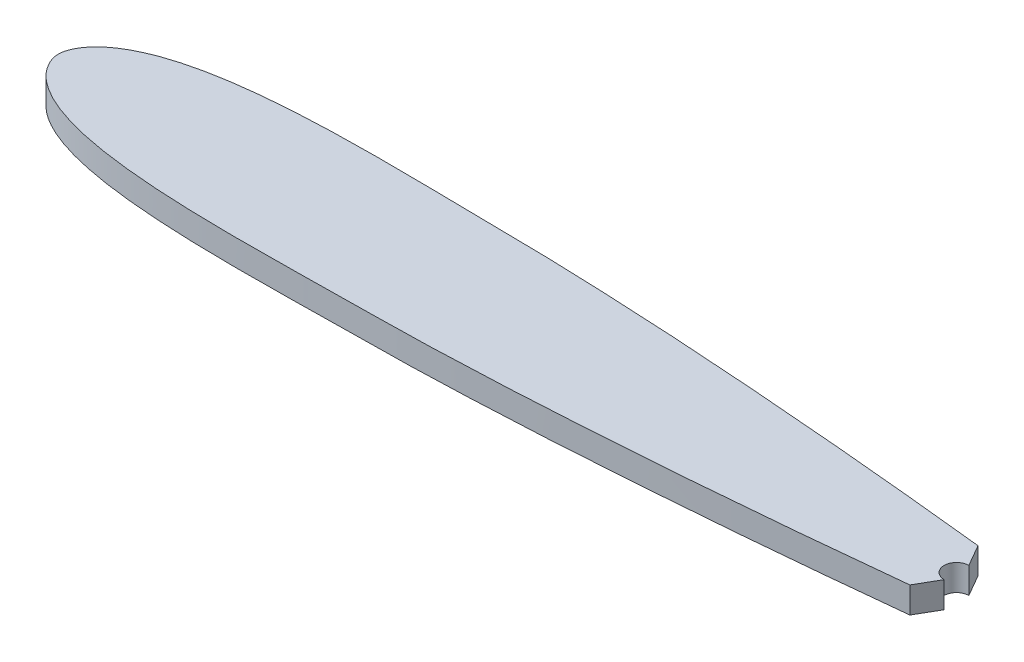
ISO-10303-21;
HEADER;
FILE_DESCRIPTION(('STEP AP214'),'2;1');
FILE_NAME('part.step','',(''),(''),'','','');
FILE_SCHEMA(('AUTOMOTIVE_DESIGN { 1 0 10303 214 1 1 1 1 }'));
ENDSEC;
DATA;
#1=APPLICATION_CONTEXT('core data for automotive mechanical design processes');
#2=APPLICATION_PROTOCOL_DEFINITION('international standard','automotive_design',2000,#1);
#3=PRODUCT_CONTEXT('',#1,'mechanical');
#4=PRODUCT('Part','Part','',(#3));
#5=PRODUCT_RELATED_PRODUCT_CATEGORY('part','',(#4));
#6=PRODUCT_DEFINITION_FORMATION('','',#4);
#7=PRODUCT_DEFINITION_CONTEXT('part definition',#1,'design');
#8=PRODUCT_DEFINITION('design','',#6,#7);
#9=PRODUCT_DEFINITION_SHAPE('','',#8);
#10=(LENGTH_UNIT() NAMED_UNIT(*) SI_UNIT(.MILLI.,.METRE.));
#11=(NAMED_UNIT(*) PLANE_ANGLE_UNIT() SI_UNIT($,.RADIAN.));
#12=(NAMED_UNIT(*) SI_UNIT($,.STERADIAN.) SOLID_ANGLE_UNIT());
#13=UNCERTAINTY_MEASURE_WITH_UNIT(LENGTH_MEASURE(1.E-05),#10,'distance_accuracy_value','');
#14=(GEOMETRIC_REPRESENTATION_CONTEXT(3) GLOBAL_UNCERTAINTY_ASSIGNED_CONTEXT((#13)) GLOBAL_UNIT_ASSIGNED_CONTEXT((#10,
#11,#12)) REPRESENTATION_CONTEXT('',''));
#15=CARTESIAN_POINT('',(0.,0.,0.));
#16=DIRECTION('',(0.,0.,1.));
#17=DIRECTION('',(1.,0.,0.));
#18=AXIS2_PLACEMENT_3D('',#15,#16,#17);
#19=CARTESIAN_POINT('',(67.7790397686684,3.175,-0.131246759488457));
#20=CARTESIAN_POINT('',(65.0370068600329,3.175,-0.509034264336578));
#21=CARTESIAN_POINT('',(59.9652619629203,3.175,-1.21325090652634));
#22=CARTESIAN_POINT('',(52.5544718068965,3.175,-2.15837468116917));
#23=CARTESIAN_POINT('',(45.5543935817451,3.175,-3.00647836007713));
#24=CARTESIAN_POINT('',(36.2238895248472,3.175,-4.06883233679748));
#25=CARTESIAN_POINT('',(26.8903333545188,3.175,-5.04184253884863));
#26=CARTESIAN_POINT('',(17.5539686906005,3.175,-5.91943711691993));
#27=CARTESIAN_POINT('',(10.5538202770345,3.175,-6.52129772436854));
#28=CARTESIAN_POINT('',(3.55392530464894,3.175,-7.06802957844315));
#29=CARTESIAN_POINT('',(-3.49280084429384,3.175,-7.55014307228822));
#30=CARTESIAN_POINT('',(-10.5393160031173,3.175,-7.96271458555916));
#31=CARTESIAN_POINT('',(-17.5865793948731,3.175,-8.2681854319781));
#32=CARTESIAN_POINT('',(-24.5870390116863,3.175,-8.49389357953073));
#33=CARTESIAN_POINT('',(-30.3756781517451,3.175,-8.48994880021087));
#34=CARTESIAN_POINT('',(-34.9949715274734,3.175,-8.59752197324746));
#35=CARTESIAN_POINT('',(-40.7817640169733,3.175,-8.67810250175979));
#36=CARTESIAN_POINT('',(-47.7881212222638,3.175,-8.68162886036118));
#37=CARTESIAN_POINT('',(-54.7937707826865,3.175,-8.31167413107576));
#38=CARTESIAN_POINT('',(-59.22630516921,3.175,-7.81823452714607));
#39=CARTESIAN_POINT('',(-62.2656748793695,3.175,-7.31987094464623));
#40=CARTESIAN_POINT('',(-64.6009038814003,3.175,-6.7884320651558));
#41=CARTESIAN_POINT('',(-66.4620466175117,3.175,-6.22573553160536));
#42=CARTESIAN_POINT('',(-67.8707051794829,3.175,-5.7108879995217));
#43=CARTESIAN_POINT('',(-69.2876418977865,3.175,-5.0652949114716));
#44=CARTESIAN_POINT('',(-70.7296719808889,3.175,-4.21938046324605));
#45=CARTESIAN_POINT('',(-71.9258731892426,3.175,-3.23008464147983));
#46=CARTESIAN_POINT('',(-72.9793832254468,3.175,-1.90586842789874));
#47=CARTESIAN_POINT('',(-73.754817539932,3.175,-0.124102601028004));
#48=CARTESIAN_POINT('',(-72.9793832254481,3.175,1.6576632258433));
#49=CARTESIAN_POINT('',(-71.9258731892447,3.175,2.98187943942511));
#50=CARTESIAN_POINT('',(-70.7296719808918,3.175,3.97117526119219));
#51=CARTESIAN_POINT('',(-69.28764189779,3.175,4.81708970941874));
#52=CARTESIAN_POINT('',(-67.8707051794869,3.175,5.46268279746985));
#53=CARTESIAN_POINT('',(-66.4620466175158,3.175,5.9775303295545));
#54=CARTESIAN_POINT('',(-64.6009038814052,3.175,6.54022686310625));
#55=CARTESIAN_POINT('',(-62.2656748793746,3.175,7.07166574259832));
#56=CARTESIAN_POINT('',(-59.2263051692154,3.175,7.57002932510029));
#57=CARTESIAN_POINT('',(-54.7937707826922,3.175,8.06346892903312));
#58=CARTESIAN_POINT('',(-47.7881212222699,3.175,8.43342365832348));
#59=CARTESIAN_POINT('',(-40.7817640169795,3.175,8.42989729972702));
#60=CARTESIAN_POINT('',(-34.9949715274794,3.175,8.34931677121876));
#61=CARTESIAN_POINT('',(-30.375678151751,3.175,8.24174359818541));
#62=CARTESIAN_POINT('',(-24.5870390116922,3.175,8.24568837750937));
#63=CARTESIAN_POINT('',(-17.5865793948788,3.175,8.01998022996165));
#64=CARTESIAN_POINT('',(-10.5393160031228,3.175,7.71450938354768));
#65=CARTESIAN_POINT('',(-3.492800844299,3.175,7.30193787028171));
#66=CARTESIAN_POINT('',(3.55392530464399,3.175,6.8198243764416));
#67=CARTESIAN_POINT('',(10.5538202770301,3.175,6.27309252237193));
#68=CARTESIAN_POINT('',(17.5539686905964,3.175,5.67123191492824));
#69=CARTESIAN_POINT('',(26.8903333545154,3.175,4.79363733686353));
#70=CARTESIAN_POINT('',(36.2238895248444,3.175,3.82062713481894));
#71=CARTESIAN_POINT('',(45.5543935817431,3.175,2.75827315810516));
#72=CARTESIAN_POINT('',(52.5544718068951,3.175,1.91016947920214));
#73=CARTESIAN_POINT('',(59.9715547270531,3.175,0.964243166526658));
#74=CARTESIAN_POINT('',(65.0495736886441,3.175,0.259084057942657));
#75=CARTESIAN_POINT('',(67.7978926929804,3.175,-0.119555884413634));
#76=B_SPLINE_CURVE_WITH_KNOTS('',3,(#19,#20,#21,#22,#23,#24,#25,#26,#27,#28,#29,#30,#31,#32,#33,
#34,#35,#36,#37,#38,#39,#40,#41,#42,#43,#44,#45,#46,#47,#48,#49,#50,#51,#52,#53,#54,#55,#56,#57,
#58,#59,#60,#61,#62,#63,#64,#65,#66,#67,#68,#69,#70,#71,#72,#73,#74,#75),.UNSPECIFIED.,.F.,.F.,
(4,1,1,1,1,1,1,1,1,1,1,1,1,1,1,1,1,1,1,1,1,1,1,1,1,1,1,1,1,1,1,1,1,1,1,1,1,1,1,1,1,1,1,1,1,1,1,
1,1,1,1,1,1,1,4),(-0.00432084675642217,0.0246342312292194,0.0492428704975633,0.0738297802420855,
0.0983967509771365,0.147478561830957,0.171994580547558,0.196493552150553,0.220976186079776,
0.245442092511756,0.270380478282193,0.29481296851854,0.319231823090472,0.343641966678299,
0.355360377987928,0.367566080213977,0.404182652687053,0.428636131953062,0.440920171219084,
0.450818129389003,0.460843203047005,0.465945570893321,0.471149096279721,0.476522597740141,
0.482208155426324,0.488618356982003,0.492567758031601,0.5,0.507432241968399,0.511381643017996,
0.517791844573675,0.523477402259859,0.528850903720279,0.534054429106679,0.539156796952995,
0.549181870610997,0.559079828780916,0.571363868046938,0.595817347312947,0.632433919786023,
0.644639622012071,0.656358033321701,0.680768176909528,0.70518703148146,0.729619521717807,
0.754557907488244,0.779023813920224,0.803506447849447,0.828005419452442,0.852521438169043,
0.901603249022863,0.926170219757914,0.950757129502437,0.975365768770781,1.00438720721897),.UNSPECIFIED.);
#77=DIRECTION('',(0.,-1.,0.));
#78=VECTOR('',#77,1.);
#79=SURFACE_OF_LINEAR_EXTRUSION('',#76,#78);
#80=CARTESIAN_POINT('',(34.2509462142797,3.175,4.01545479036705));
#81=CARTESIAN_POINT('',(31.0193228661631,3.175,4.36017962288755));
#82=CARTESIAN_POINT('',(25.4546897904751,3.175,4.9285841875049));
#83=CARTESIAN_POINT('',(17.5539686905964,3.175,5.67123191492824));
#84=CARTESIAN_POINT('',(10.5538202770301,3.175,6.27309252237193));
#85=CARTESIAN_POINT('',(3.55392530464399,3.175,6.8198243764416));
#86=CARTESIAN_POINT('',(-3.492800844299,3.175,7.30193787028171));
#87=CARTESIAN_POINT('',(-10.5393160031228,3.175,7.71450938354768));
#88=CARTESIAN_POINT('',(-17.5865793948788,3.175,8.01998022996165));
#89=CARTESIAN_POINT('',(-24.5870390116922,3.175,8.24568837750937));
#90=CARTESIAN_POINT('',(-30.375678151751,3.175,8.24174359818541));
#91=CARTESIAN_POINT('',(-34.9949715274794,3.175,8.34931677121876));
#92=CARTESIAN_POINT('',(-40.7817640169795,3.175,8.42989729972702));
#93=CARTESIAN_POINT('',(-47.7881212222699,3.175,8.43342365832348));
#94=CARTESIAN_POINT('',(-54.7937707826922,3.175,8.06346892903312));
#95=CARTESIAN_POINT('',(-59.2263051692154,3.175,7.57002932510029));
#96=CARTESIAN_POINT('',(-62.2656748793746,3.175,7.07166574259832));
#97=CARTESIAN_POINT('',(-64.6009038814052,3.175,6.54022686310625));
#98=CARTESIAN_POINT('',(-66.4620466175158,3.175,5.9775303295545));
#99=CARTESIAN_POINT('',(-67.8707051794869,3.175,5.46268279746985));
#100=CARTESIAN_POINT('',(-69.28764189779,3.175,4.81708970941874));
#101=CARTESIAN_POINT('',(-70.7296719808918,3.175,3.97117526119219));
#102=CARTESIAN_POINT('',(-71.9258731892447,3.175,2.98187943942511));
#103=CARTESIAN_POINT('',(-72.9793832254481,3.175,1.6576632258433));
#104=CARTESIAN_POINT('',(-73.754817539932,3.175,-0.124102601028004));
#105=CARTESIAN_POINT('',(-72.9793832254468,3.175,-1.90586842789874));
#106=CARTESIAN_POINT('',(-71.9258731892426,3.175,-3.23008464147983));
#107=CARTESIAN_POINT('',(-70.7296719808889,3.175,-4.21938046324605));
#108=CARTESIAN_POINT('',(-69.2876418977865,3.175,-5.0652949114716));
#109=CARTESIAN_POINT('',(-67.8707051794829,3.175,-5.7108879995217));
#110=CARTESIAN_POINT('',(-66.4620466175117,3.175,-6.22573553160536));
#111=CARTESIAN_POINT('',(-64.6009038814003,3.175,-6.7884320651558));
#112=CARTESIAN_POINT('',(-62.2656748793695,3.175,-7.31987094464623));
#113=CARTESIAN_POINT('',(-59.22630516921,3.175,-7.81823452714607));
#114=CARTESIAN_POINT('',(-54.7937707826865,3.175,-8.31167413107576));
#115=CARTESIAN_POINT('',(-47.7881212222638,3.175,-8.68162886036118));
#116=CARTESIAN_POINT('',(-40.7817640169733,3.175,-8.67810250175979));
#117=CARTESIAN_POINT('',(-34.9949715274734,3.175,-8.59752197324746));
#118=CARTESIAN_POINT('',(-30.3756781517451,3.175,-8.48994880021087));
#119=CARTESIAN_POINT('',(-24.5870390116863,3.175,-8.49389357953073));
#120=CARTESIAN_POINT('',(-17.5865793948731,3.175,-8.2681854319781));
#121=CARTESIAN_POINT('',(-10.5393160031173,3.175,-7.96271458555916));
#122=CARTESIAN_POINT('',(-3.49280084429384,3.175,-7.55014307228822));
#123=CARTESIAN_POINT('',(3.55392530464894,3.175,-7.06802957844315));
#124=CARTESIAN_POINT('',(10.5538202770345,3.175,-6.52129772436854));
#125=CARTESIAN_POINT('',(17.5539686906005,3.175,-5.91943711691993));
#126=CARTESIAN_POINT('',(25.4576237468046,3.175,-5.17651360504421));
#127=CARTESIAN_POINT('',(31.0251861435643,3.175,-4.60778590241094));
#128=CARTESIAN_POINT('',(34.2597369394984,3.175,-4.26272222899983));
#129=B_SPLINE_CURVE_WITH_KNOTS('',3,(#80,#81,#82,#83,#84,#85,#86,#87,#88,#89,#90,#91,#92,#93,
#94,#95,#96,#97,#98,#99,#100,#101,#102,#103,#104,#105,#106,#107,#108,#109,#110,#111,#112,#113,
#114,#115,#116,#117,#118,#119,#120,#121,#122,#123,#124,#125,#126,#127,#128),.UNSPECIFIED.,.F.,
.F.,(4,1,1,1,1,1,1,1,1,1,1,1,1,1,1,1,1,1,1,1,1,1,1,1,1,1,1,1,1,1,1,1,1,1,1,1,1,1,1,1,1,1,1,1,1,
1,4),(0.113450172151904,0.147447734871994,0.171963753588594,0.196462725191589,0.220945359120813,
0.245411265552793,0.27034965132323,0.294782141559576,0.319200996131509,0.343611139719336,
0.355329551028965,0.367535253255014,0.404151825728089,0.428605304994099,0.440889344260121,
0.45078730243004,0.460812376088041,0.465914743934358,0.471118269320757,0.476491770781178,
0.482177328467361,0.48858753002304,0.492536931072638,0.499969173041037,0.507401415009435,
0.511350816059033,0.517761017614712,0.523446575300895,0.528820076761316,0.534023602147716,
0.539125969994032,0.549151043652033,0.559049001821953,0.571333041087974,0.595786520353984,
0.63240309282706,0.644608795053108,0.656327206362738,0.680737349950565,0.705156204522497,
0.729588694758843,0.754527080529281,0.77899298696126,0.803475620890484,0.827974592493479,
0.852490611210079,0.886519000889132),.UNSPECIFIED.);
#130=CARTESIAN_POINT('',(34.2597400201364,3.175,-4.26275110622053));
#131=VERTEX_POINT('',#130);
#132=CARTESIAN_POINT('',(34.2509492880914,3.175,4.01548360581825));
#133=VERTEX_POINT('',#132);
#134=EDGE_CURVE('E11',#131,#133,#129,.F.);
#135=ORIENTED_EDGE('',*,*,#134,.F.);
#136=DIRECTION('',(0.,-1.,0.));
#137=VECTOR('',#136,1.);
#138=CARTESIAN_POINT('',(34.2597579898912,1.5874875,-4.26271998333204));
#139=LINE('',#138,#137);
#140=CARTESIAN_POINT('',(34.2597579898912,-1.24999999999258E-05,-4.26271998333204));
#141=VERTEX_POINT('',#140);
#142=EDGE_CURVE('E95',#141,#131,#139,.F.);
#143=ORIENTED_EDGE('',*,*,#142,.F.);
#144=CARTESIAN_POINT('',(67.7790397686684,0.,-0.131246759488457));
#145=CARTESIAN_POINT('',(65.0370068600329,0.,-0.509034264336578));
#146=CARTESIAN_POINT('',(59.9652619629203,0.,-1.21325090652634));
#147=CARTESIAN_POINT('',(52.5544718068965,0.,-2.15837468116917));
#148=CARTESIAN_POINT('',(45.5543935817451,0.,-3.00647836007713));
#149=CARTESIAN_POINT('',(36.2238895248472,0.,-4.06883233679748));
#150=CARTESIAN_POINT('',(26.8903333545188,0.,-5.04184253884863));
#151=CARTESIAN_POINT('',(17.5539686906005,0.,-5.91943711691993));
#152=CARTESIAN_POINT('',(10.5538202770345,0.,-6.52129772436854));
#153=CARTESIAN_POINT('',(3.55392530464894,0.,-7.06802957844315));
#154=CARTESIAN_POINT('',(-3.49280084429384,0.,-7.55014307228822));
#155=CARTESIAN_POINT('',(-10.5393160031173,0.,-7.96271458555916));
#156=CARTESIAN_POINT('',(-17.5865793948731,0.,-8.2681854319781));
#157=CARTESIAN_POINT('',(-24.5870390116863,0.,-8.49389357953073));
#158=CARTESIAN_POINT('',(-30.3756781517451,0.,-8.48994880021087));
#159=CARTESIAN_POINT('',(-34.9949715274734,0.,-8.59752197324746));
#160=CARTESIAN_POINT('',(-40.7817640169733,0.,-8.67810250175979));
#161=CARTESIAN_POINT('',(-47.7881212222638,0.,-8.68162886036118));
#162=CARTESIAN_POINT('',(-54.7937707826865,0.,-8.31167413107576));
#163=CARTESIAN_POINT('',(-59.22630516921,0.,-7.81823452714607));
#164=CARTESIAN_POINT('',(-62.2656748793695,0.,-7.31987094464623));
#165=CARTESIAN_POINT('',(-64.6009038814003,0.,-6.7884320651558));
#166=CARTESIAN_POINT('',(-66.4620466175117,0.,-6.22573553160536));
#167=CARTESIAN_POINT('',(-67.8707051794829,0.,-5.7108879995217));
#168=CARTESIAN_POINT('',(-69.2876418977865,0.,-5.0652949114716));
#169=CARTESIAN_POINT('',(-70.7296719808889,0.,-4.21938046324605));
#170=CARTESIAN_POINT('',(-71.9258731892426,0.,-3.23008464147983));
#171=CARTESIAN_POINT('',(-72.9793832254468,0.,-1.90586842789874));
#172=CARTESIAN_POINT('',(-73.754817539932,0.,-0.124102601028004));
#173=CARTESIAN_POINT('',(-72.9793832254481,0.,1.6576632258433));
#174=CARTESIAN_POINT('',(-71.9258731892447,0.,2.98187943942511));
#175=CARTESIAN_POINT('',(-70.7296719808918,0.,3.97117526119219));
#176=CARTESIAN_POINT('',(-69.28764189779,0.,4.81708970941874));
#177=CARTESIAN_POINT('',(-67.8707051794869,0.,5.46268279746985));
#178=CARTESIAN_POINT('',(-66.4620466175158,0.,5.9775303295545));
#179=CARTESIAN_POINT('',(-64.6009038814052,0.,6.54022686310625));
#180=CARTESIAN_POINT('',(-62.2656748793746,0.,7.07166574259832));
#181=CARTESIAN_POINT('',(-59.2263051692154,0.,7.57002932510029));
#182=CARTESIAN_POINT('',(-54.7937707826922,0.,8.06346892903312));
#183=CARTESIAN_POINT('',(-47.7881212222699,0.,8.43342365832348));
#184=CARTESIAN_POINT('',(-40.7817640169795,0.,8.42989729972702));
#185=CARTESIAN_POINT('',(-34.9949715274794,0.,8.34931677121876));
#186=CARTESIAN_POINT('',(-30.375678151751,0.,8.24174359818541));
#187=CARTESIAN_POINT('',(-24.5870390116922,0.,8.24568837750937));
#188=CARTESIAN_POINT('',(-17.5865793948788,0.,8.01998022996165));
#189=CARTESIAN_POINT('',(-10.5393160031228,0.,7.71450938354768));
#190=CARTESIAN_POINT('',(-3.492800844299,0.,7.30193787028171));
#191=CARTESIAN_POINT('',(3.55392530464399,0.,6.8198243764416));
#192=CARTESIAN_POINT('',(10.5538202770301,0.,6.27309252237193));
#193=CARTESIAN_POINT('',(17.5539686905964,0.,5.67123191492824));
#194=CARTESIAN_POINT('',(26.8903333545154,0.,4.79363733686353));
#195=CARTESIAN_POINT('',(36.2238895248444,0.,3.82062713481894));
#196=CARTESIAN_POINT('',(45.5543935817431,0.,2.75827315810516));
#197=CARTESIAN_POINT('',(52.5544718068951,0.,1.91016947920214));
#198=CARTESIAN_POINT('',(59.9715547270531,0.,0.964243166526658));
#199=CARTESIAN_POINT('',(65.0495736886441,0.,0.259084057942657));
#200=CARTESIAN_POINT('',(67.7978926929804,0.,-0.119555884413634));
#201=B_SPLINE_CURVE_WITH_KNOTS('',3,(#144,#145,#146,#147,#148,#149,#150,#151,#152,#153,#154,
#155,#156,#157,#158,#159,#160,#161,#162,#163,#164,#165,#166,#167,#168,#169,#170,#171,#172,#173,
#174,#175,#176,#177,#178,#179,#180,#181,#182,#183,#184,#185,#186,#187,#188,#189,#190,#191,#192,
#193,#194,#195,#196,#197,#198,#199,#200),.UNSPECIFIED.,.F.,.F.,(4,1,1,1,1,1,1,1,1,1,1,1,1,1,1,1,
1,1,1,1,1,1,1,1,1,1,1,1,1,1,1,1,1,1,1,1,1,1,1,1,1,1,1,1,1,1,1,1,1,1,1,1,1,1,4),
(-0.00432084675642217,0.0246342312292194,0.0492428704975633,0.0738297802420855,
0.0983967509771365,0.147478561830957,0.171994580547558,0.196493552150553,0.220976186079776,
0.245442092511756,0.270380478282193,0.29481296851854,0.319231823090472,0.343641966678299,
0.355360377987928,0.367566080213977,0.404182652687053,0.428636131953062,0.440920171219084,
0.450818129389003,0.460843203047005,0.465945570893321,0.471149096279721,0.476522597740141,
0.482208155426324,0.488618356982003,0.492567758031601,0.5,0.507432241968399,0.511381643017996,
0.517791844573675,0.523477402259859,0.528850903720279,0.534054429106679,0.539156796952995,
0.549181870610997,0.559079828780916,0.571363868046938,0.595817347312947,0.632433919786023,
0.644639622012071,0.656358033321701,0.680768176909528,0.70518703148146,0.729619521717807,
0.754557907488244,0.779023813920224,0.803506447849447,0.828005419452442,0.852521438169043,
0.901603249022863,0.926170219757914,0.950757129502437,0.975365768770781,1.00438720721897),.UNSPECIFIED.);
#202=CARTESIAN_POINT('',(34.2509672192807,-1.24999999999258E-05,4.01545254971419));
#203=VERTEX_POINT('',#202);
#204=EDGE_CURVE('E61',#141,#203,#201,.T.);
#205=ORIENTED_EDGE('',*,*,#204,.T.);
#206=DIRECTION('',(0.,-1.,0.));
#207=VECTOR('',#206,1.);
#208=CARTESIAN_POINT('',(34.2509672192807,1.5874875,4.01545254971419));
#209=LINE('',#208,#207);
#210=EDGE_CURVE('E108',#203,#133,#209,.F.);
#211=ORIENTED_EDGE('',*,*,#210,.T.);
#212=EDGE_LOOP('',(#135,#143,#205,#211));
#213=FACE_BOUND('',#212,.T.);
#214=ADVANCED_FACE('F49',(#213),#79,.F.);
#215=CARTESIAN_POINT('',(-73.4484714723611,3.175,-0.114675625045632));
#216=DIRECTION('',(0.,1.,0.));
#217=DIRECTION('',(0.,0.,1.));
#218=AXIS2_PLACEMENT_3D('',#215,#216,#217);
#219=PLANE('',#218);
#220=DIRECTION('',(0.500000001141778,0.,0.866025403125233));
#221=VECTOR('',#220,1.);
#222=CARTESIAN_POINT('',(9.12885639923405,3.175,-47.7907182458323));
#223=LINE('',#222,#221);
#224=CARTESIAN_POINT('',(35.7790397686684,3.175,-1.63124675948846));
#225=VERTEX_POINT('',#224);
#226=EDGE_CURVE('E68',#131,#225,#223,.T.);
#227=ORIENTED_EDGE('',*,*,#226,.F.);
#228=ORIENTED_EDGE('',*,*,#134,.T.);
#229=DIRECTION('',(-0.499999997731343,0.,0.866025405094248));
#230=VECTOR('',#229,1.);
#231=CARTESIAN_POINT('',(9.11450574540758,3.175,47.553081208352));
#232=LINE('',#231,#230);
#233=CARTESIAN_POINT('',(35.7790397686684,3.175,1.36875324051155));
#234=VERTEX_POINT('',#233);
#235=EDGE_CURVE('E102',#234,#133,#232,.T.);
#236=ORIENTED_EDGE('',*,*,#235,.F.);
#237=CARTESIAN_POINT('',(35.7790397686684,3.175,-0.131246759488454));
#238=DIRECTION('',(0.,1.,0.));
#239=DIRECTION('',(0.,0.,1.));
#240=AXIS2_PLACEMENT_3D('',#237,#238,#239);
#241=CIRCLE('',#240,1.5);
#242=EDGE_CURVE('E116',#225,#234,#241,.T.);
#243=ORIENTED_EDGE('',*,*,#242,.F.);
#244=EDGE_LOOP('',(#227,#228,#236,#243));
#245=FACE_BOUND('',#244,.T.);
#246=ADVANCED_FACE('F135',(#245),#219,.T.);
#247=CARTESIAN_POINT('',(-73.4484714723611,0.,-0.114675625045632));
#248=DIRECTION('',(0.,1.,0.));
#249=DIRECTION('',(0.,0.,1.));
#250=AXIS2_PLACEMENT_3D('',#247,#248,#249);
#251=PLANE('',#250);
#252=CARTESIAN_POINT('',(-52.198485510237,0.,-0.119555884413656));
#253=DIRECTION('',(0.,-1.,0.));
#254=DIRECTION('',(0.,0.,-1.));
#255=AXIS2_PLACEMENT_3D('',#252,#253,#254);
#256=CIRCLE('',#255,1.5);
#257=CARTESIAN_POINT('',(-52.198485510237,0.,-1.61955588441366));
#258=VERTEX_POINT('',#257);
#259=EDGE_CURVE('E232',#258,#258,#256,.T.);
#260=ORIENTED_EDGE('',*,*,#259,.F.);
#261=EDGE_LOOP('',(#260));
#262=FACE_BOUND('',#261,.T.);
#263=ORIENTED_EDGE('',*,*,#204,.F.);
#264=DIRECTION('',(0.500000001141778,0.,0.866025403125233));
#265=VECTOR('',#264,1.);
#266=CARTESIAN_POINT('',(9.12885639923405,0.,-47.7907182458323));
#267=LINE('',#266,#265);
#268=CARTESIAN_POINT('',(35.7790397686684,0.,-1.63124675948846));
#269=VERTEX_POINT('',#268);
#270=EDGE_CURVE('E92',#141,#269,#267,.T.);
#271=ORIENTED_EDGE('',*,*,#270,.T.);
#272=CARTESIAN_POINT('',(35.7790397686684,0.,-0.131246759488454));
#273=DIRECTION('',(0.,1.,0.));
#274=DIRECTION('',(0.,0.,1.));
#275=AXIS2_PLACEMENT_3D('',#272,#273,#274);
#276=CIRCLE('',#275,1.5);
#277=CARTESIAN_POINT('',(35.7790397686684,0.,1.36875324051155));
#278=VERTEX_POINT('',#277);
#279=EDGE_CURVE('E112',#269,#278,#276,.T.);
#280=ORIENTED_EDGE('',*,*,#279,.T.);
#281=DIRECTION('',(-0.499999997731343,0.,0.866025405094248));
#282=VECTOR('',#281,1.);
#283=CARTESIAN_POINT('',(9.11450574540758,0.,47.553081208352));
#284=LINE('',#283,#282);
#285=EDGE_CURVE('E76',#278,#203,#284,.T.);
#286=ORIENTED_EDGE('',*,*,#285,.T.);
#287=EDGE_LOOP('',(#263,#271,#280,#286));
#288=FACE_BOUND('',#287,.T.);
#289=ADVANCED_FACE('F110',(#262,#288),#251,.F.);
#290=CARTESIAN_POINT('',(35.7790397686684,0.,-0.131246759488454));
#291=DIRECTION('',(0.,1.,0.));
#292=DIRECTION('',(0.,0.,1.));
#293=AXIS2_PLACEMENT_3D('',#290,#291,#292);
#294=CYLINDRICAL_SURFACE('',#293,1.5);
#295=ORIENTED_EDGE('',*,*,#242,.T.);
#296=DIRECTION('',(0.,1.,0.));
#297=VECTOR('',#296,1.);
#298=CARTESIAN_POINT('',(35.7790397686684,0.,1.36875324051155));
#299=LINE('',#298,#297);
#300=EDGE_CURVE('E213',#278,#234,#299,.T.);
#301=ORIENTED_EDGE('',*,*,#300,.F.);
#302=ORIENTED_EDGE('',*,*,#279,.F.);
#303=DIRECTION('',(0.,1.,0.));
#304=VECTOR('',#303,1.);
#305=CARTESIAN_POINT('',(35.7790397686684,0.,-1.63124675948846));
#306=LINE('',#305,#304);
#307=EDGE_CURVE('E96',#269,#225,#306,.T.);
#308=ORIENTED_EDGE('',*,*,#307,.T.);
#309=EDGE_LOOP('',(#295,#301,#302,#308));
#310=FACE_BOUND('',#309,.T.);
#311=ADVANCED_FACE('F145',(#310),#294,.F.);
#312=CARTESIAN_POINT('',(-52.198485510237,1.5875,-0.119555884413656));
#313=DIRECTION('',(0.,-1.,0.));
#314=DIRECTION('',(0.,0.,-1.));
#315=AXIS2_PLACEMENT_3D('',#312,#313,#314);
#316=CYLINDRICAL_SURFACE('',#315,1.5);
#317=CARTESIAN_POINT('',(-52.198485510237,1.5875,-0.119555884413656));
#318=DIRECTION('',(0.,-1.,0.));
#319=DIRECTION('',(0.,0.,-1.));
#320=AXIS2_PLACEMENT_3D('',#317,#318,#319);
#321=CIRCLE('',#320,1.5);
#322=CARTESIAN_POINT('',(-52.198485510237,1.5875,-1.61955588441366));
#323=VERTEX_POINT('',#322);
#324=EDGE_CURVE('E233',#323,#323,#321,.T.);
#325=ORIENTED_EDGE('',*,*,#324,.F.);
#326=EDGE_LOOP('',(#325));
#327=FACE_BOUND('',#326,.T.);
#328=ORIENTED_EDGE('',*,*,#259,.T.);
#329=EDGE_LOOP('',(#328));
#330=FACE_BOUND('',#329,.T.);
#331=ADVANCED_FACE('F152',(#327,#330),#316,.F.);
#332=CARTESIAN_POINT('',(-52.198485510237,1.5875,-0.119555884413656));
#333=DIRECTION('',(0.,-1.,0.));
#334=DIRECTION('',(0.,0.,-1.));
#335=AXIS2_PLACEMENT_3D('',#332,#333,#334);
#336=PLANE('',#335);
#337=ORIENTED_EDGE('',*,*,#324,.T.);
#338=EDGE_LOOP('',(#337));
#339=FACE_BOUND('',#338,.T.);
#340=ADVANCED_FACE('F163',(#339),#336,.T.);
#341=CARTESIAN_POINT('',(35.7790397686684,-2.49999999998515E-05,1.36875324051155));
#342=DIRECTION('',(-0.866025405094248,0.,-0.499999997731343));
#343=DIRECTION('',(-0.499999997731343,0.,0.866025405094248));
#344=AXIS2_PLACEMENT_3D('',#341,#342,#343);
#345=PLANE('',#344);
#346=ORIENTED_EDGE('',*,*,#235,.T.);
#347=ORIENTED_EDGE('',*,*,#210,.F.);
#348=ORIENTED_EDGE('',*,*,#285,.F.);
#349=ORIENTED_EDGE('',*,*,#300,.T.);
#350=EDGE_LOOP('',(#346,#347,#348,#349));
#351=FACE_BOUND('',#350,.T.);
#352=ADVANCED_FACE('F194',(#351),#345,.F.);
#353=CARTESIAN_POINT('',(35.7790397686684,-2.49999999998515E-05,-1.63124675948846));
#354=DIRECTION('',(-0.866025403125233,0.,0.500000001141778));
#355=DIRECTION('',(0.500000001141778,0.,0.866025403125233));
#356=AXIS2_PLACEMENT_3D('',#353,#354,#355);
#357=PLANE('',#356);
#358=ORIENTED_EDGE('',*,*,#226,.T.);
#359=ORIENTED_EDGE('',*,*,#307,.F.);
#360=ORIENTED_EDGE('',*,*,#270,.F.);
#361=ORIENTED_EDGE('',*,*,#142,.T.);
#362=EDGE_LOOP('',(#358,#359,#360,#361));
#363=FACE_BOUND('',#362,.T.);
#364=ADVANCED_FACE('F94',(#363),#357,.F.);
#365=CLOSED_SHELL('',(#214,#246,#289,#311,#331,#340,#352,#364));
#366=MANIFOLD_SOLID_BREP('B2',#365);
#367=ADVANCED_BREP_SHAPE_REPRESENTATION('',(#18,#366),#14);
#368=SHAPE_DEFINITION_REPRESENTATION(#9,#367);
ENDSEC;
END-ISO-10303-21;
